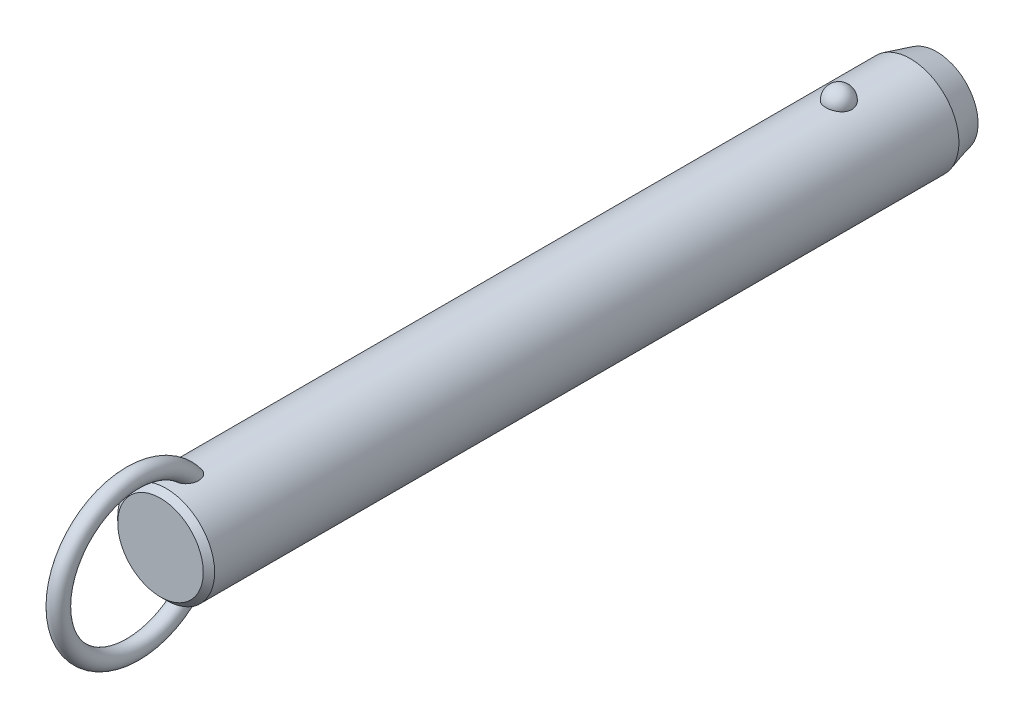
ISO-10303-21;
HEADER;
FILE_DESCRIPTION(('STEP AP214'),'2;1');
FILE_NAME('part.step','',(''),(''),'','','');
FILE_SCHEMA(('AUTOMOTIVE_DESIGN { 1 0 10303 214 1 1 1 1 }'));
ENDSEC;
DATA;
#1=APPLICATION_CONTEXT('core data for automotive mechanical design processes');
#2=APPLICATION_PROTOCOL_DEFINITION('international standard','automotive_design',2000,#1);
#3=PRODUCT_CONTEXT('',#1,'mechanical');
#4=PRODUCT('Part','Part','',(#3));
#5=PRODUCT_RELATED_PRODUCT_CATEGORY('part','',(#4));
#6=PRODUCT_DEFINITION_FORMATION('','',#4);
#7=PRODUCT_DEFINITION_CONTEXT('part definition',#1,'design');
#8=PRODUCT_DEFINITION('design','',#6,#7);
#9=PRODUCT_DEFINITION_SHAPE('','',#8);
#10=(LENGTH_UNIT() NAMED_UNIT(*) SI_UNIT(.MILLI.,.METRE.));
#11=(NAMED_UNIT(*) PLANE_ANGLE_UNIT() SI_UNIT($,.RADIAN.));
#12=(NAMED_UNIT(*) SI_UNIT($,.STERADIAN.) SOLID_ANGLE_UNIT());
#13=UNCERTAINTY_MEASURE_WITH_UNIT(LENGTH_MEASURE(1.E-05),#10,'distance_accuracy_value','');
#14=(GEOMETRIC_REPRESENTATION_CONTEXT(3) GLOBAL_UNCERTAINTY_ASSIGNED_CONTEXT((#13)) GLOBAL_UNIT_ASSIGNED_CONTEXT((#10,
#11,#12)) REPRESENTATION_CONTEXT('',''));
#15=CARTESIAN_POINT('',(0.,0.,0.));
#16=DIRECTION('',(0.,0.,1.));
#17=DIRECTION('',(1.,0.,0.));
#18=AXIS2_PLACEMENT_3D('',#15,#16,#17);
#19=CARTESIAN_POINT('',(0.,0.,139.7));
#20=DIRECTION('',(0.,0.,-1.));
#21=DIRECTION('',(-1.,0.,0.));
#22=AXIS2_PLACEMENT_3D('',#19,#20,#21);
#23=CYLINDRICAL_SURFACE('',#22,11.1);
#24=CARTESIAN_POINT('',(2.9724815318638,10.6945945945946,-3.));
#25=CARTESIAN_POINT('',(2.97247830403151,10.6945972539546,-2.83225059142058));
#26=CARTESIAN_POINT('',(2.95876598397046,10.6984356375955,-2.66445972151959));
#27=CARTESIAN_POINT('',(2.90424529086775,10.7133624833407,-2.33362381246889));
#28=CARTESIAN_POINT('',(2.8634252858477,10.7244540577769,-2.1705808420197));
#29=CARTESIAN_POINT('',(2.75573657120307,10.7526272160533,-1.85396767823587));
#30=CARTESIAN_POINT('',(2.68887937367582,10.7697061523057,-1.70039333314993));
#31=CARTESIAN_POINT('',(2.53079696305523,10.8079438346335,-1.40691598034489));
#32=CARTESIAN_POINT('',(2.43957264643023,10.8291024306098,-1.2670124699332));
#33=CARTESIAN_POINT('',(2.23458150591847,10.8732541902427,-1.00409565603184));
#34=CARTESIAN_POINT('',(2.12071295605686,10.8962553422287,-0.881162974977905));
#35=CARTESIAN_POINT('',(1.87365402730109,10.9414421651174,-0.656352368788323));
#36=CARTESIAN_POINT('',(1.74046358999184,10.9636278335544,-0.554474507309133));
#37=CARTESIAN_POINT('',(1.45872188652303,11.0046495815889,-0.374872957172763));
#38=CARTESIAN_POINT('',(1.31021276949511,11.0234944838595,-0.297085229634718));
#39=CARTESIAN_POINT('',(1.00170030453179,11.0557957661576,-0.167529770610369));
#40=CARTESIAN_POINT('',(0.841698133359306,11.0692526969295,-0.115759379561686));
#41=CARTESIAN_POINT('',(0.517607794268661,11.0890932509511,-0.0403925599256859));
#42=CARTESIAN_POINT('',(0.353633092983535,11.0955916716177,-0.0163383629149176));
#43=CARTESIAN_POINT('',(0.0238420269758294,11.1011989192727,0.0044517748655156));
#44=CARTESIAN_POINT('',(-0.141974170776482,11.1003084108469,0.00119017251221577));
#45=CARTESIAN_POINT('',(-0.468405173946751,11.0912990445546,-0.0323233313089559));
#46=CARTESIAN_POINT('',(-0.629059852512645,11.0832767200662,-0.0622147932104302));
#47=CARTESIAN_POINT('',(-0.942937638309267,11.0609962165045,-0.147645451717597));
#48=CARTESIAN_POINT('',(-1.09616062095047,11.0467379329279,-0.203185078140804));
#49=CARTESIAN_POINT('',(-1.39181061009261,11.0134071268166,-0.3387529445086));
#50=CARTESIAN_POINT('',(-1.53417383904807,10.9943086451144,-0.418913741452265));
#51=CARTESIAN_POINT('',(-1.80342160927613,10.9533667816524,-0.60144882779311));
#52=CARTESIAN_POINT('',(-1.9303046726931,10.9315231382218,-0.703825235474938));
#53=CARTESIAN_POINT('',(-2.16747598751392,10.887005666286,-0.930091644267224));
#54=CARTESIAN_POINT('',(-2.27742774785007,10.8643239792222,-1.05433291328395));
#55=CARTESIAN_POINT('',(-2.47517316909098,10.8209886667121,-1.31966633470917));
#56=CARTESIAN_POINT('',(-2.56296538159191,10.8003351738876,-1.46075958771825));
#57=CARTESIAN_POINT('',(-2.71500300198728,10.7631304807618,-1.75753646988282));
#58=CARTESIAN_POINT('',(-2.77898901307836,10.7466250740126,-1.91335887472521));
#59=CARTESIAN_POINT('',(-2.88046189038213,10.7198747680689,-2.2339152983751));
#60=CARTESIAN_POINT('',(-2.91794947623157,10.709629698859,-2.39864907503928));
#61=CARTESIAN_POINT('',(-2.96537819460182,10.6965949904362,-2.73165170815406));
#62=CARTESIAN_POINT('',(-2.97542891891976,10.693775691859,-2.89990378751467));
#63=CARTESIAN_POINT('',(-2.96804271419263,10.6958279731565,-3.235752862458));
#64=CARTESIAN_POINT('',(-2.95060646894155,10.7006993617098,-3.40334987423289));
#65=CARTESIAN_POINT('',(-2.88883358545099,10.71753912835,-3.73233906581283));
#66=CARTESIAN_POINT('',(-2.84462026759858,10.7294749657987,-3.89375610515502));
#67=CARTESIAN_POINT('',(-2.73050447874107,10.7590797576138,-4.20667949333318));
#68=CARTESIAN_POINT('',(-2.66060103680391,10.7767489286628,-4.35818546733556));
#69=CARTESIAN_POINT('',(-2.49642559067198,10.8159599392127,-4.6478542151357));
#70=CARTESIAN_POINT('',(-2.40203047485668,10.8375211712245,-4.78594458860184));
#71=CARTESIAN_POINT('',(-2.19143488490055,10.8820570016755,-5.0441038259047));
#72=CARTESIAN_POINT('',(-2.07523364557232,10.9050316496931,-5.16417205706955));
#73=CARTESIAN_POINT('',(-1.82361254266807,10.9499219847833,-5.38334833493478));
#74=CARTESIAN_POINT('',(-1.68812945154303,10.9718338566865,-5.48238464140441));
#75=CARTESIAN_POINT('',(-1.40191298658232,11.0120611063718,-5.65618873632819));
#76=CARTESIAN_POINT('',(-1.25118062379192,11.0303767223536,-5.73095813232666));
#77=CARTESIAN_POINT('',(-0.940570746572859,11.0611653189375,-5.85334725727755));
#78=CARTESIAN_POINT('',(-0.780821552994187,11.0737044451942,-5.90127578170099));
#79=CARTESIAN_POINT('',(-0.455204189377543,11.0918598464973,-5.96992976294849));
#80=CARTESIAN_POINT('',(-0.289336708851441,11.0974768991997,-5.99065827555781));
#81=CARTESIAN_POINT('',(0.0406846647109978,11.1011307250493,-6.00418773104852));
#82=CARTESIAN_POINT('',(0.204817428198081,11.099299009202,-5.99747318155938));
#83=CARTESIAN_POINT('',(0.5295530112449,11.088551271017,-5.9574031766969));
#84=CARTESIAN_POINT('',(0.69015594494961,11.0796354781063,-5.92404858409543));
#85=CARTESIAN_POINT('',(1.0027760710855,11.0557204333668,-5.83180084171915));
#86=CARTESIAN_POINT('',(1.15482001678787,11.0407414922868,-5.77299291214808));
#87=CARTESIAN_POINT('',(1.44678373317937,11.0062913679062,-5.63147366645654));
#88=CARTESIAN_POINT('',(1.58670279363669,10.9868199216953,-5.54876095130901));
#89=CARTESIAN_POINT('',(1.8527023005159,10.9451315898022,-5.36027644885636));
#90=CARTESIAN_POINT('',(1.97855158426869,10.9228788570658,-5.25418644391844));
#91=CARTESIAN_POINT('',(2.21080872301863,10.8782509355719,-5.02251354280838));
#92=CARTESIAN_POINT('',(2.31721312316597,10.8558757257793,-4.89692718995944));
#93=CARTESIAN_POINT('',(2.5094551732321,10.8130715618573,-4.62745408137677));
#94=CARTESIAN_POINT('',(2.59493284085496,10.7926798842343,-4.48330448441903));
#95=CARTESIAN_POINT('',(2.740862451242,10.7565495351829,-4.18236358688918));
#96=CARTESIAN_POINT('',(2.80132490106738,10.7408089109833,-4.02557762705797));
#97=CARTESIAN_POINT('',(2.88959070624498,10.7173718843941,-3.72475308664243));
#98=CARTESIAN_POINT('',(2.92062102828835,10.7088950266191,-3.58171216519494));
#99=CARTESIAN_POINT('',(2.96206765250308,10.6975052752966,-3.29245795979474));
#100=CARTESIAN_POINT('',(2.97248434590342,10.6945922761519,-3.14624473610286));
#101=CARTESIAN_POINT('',(2.9724815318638,10.6945945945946,-3.));
#102=B_SPLINE_CURVE_WITH_KNOTS('',3,(#24,#25,#26,#27,#28,#29,#30,#31,#32,#33,#34,#35,#36,#37,
#38,#39,#40,#41,#42,#43,#44,#45,#46,#47,#48,#49,#50,#51,#52,#53,#54,#55,#56,#57,#58,#59,#60,#61,
#62,#63,#64,#65,#66,#67,#68,#69,#70,#71,#72,#73,#74,#75,#76,#77,#78,#79,#80,#81,#82,#83,#84,#85,
#86,#87,#88,#89,#90,#91,#92,#93,#94,#95,#96,#97,#98,#99,#100,#101),.UNSPECIFIED.,.T.,.F.,(4,2,2,
2,2,2,2,2,2,2,2,2,2,2,2,2,2,2,2,2,2,2,2,2,2,2,2,2,2,2,2,2,2,2,2,2,2,2,4),(0.,0.502722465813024,
1.00566079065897,1.5083769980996,2.01107471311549,2.51608392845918,3.02109467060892,
3.52475118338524,4.02835620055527,4.523518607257,5.0186364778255,5.50715297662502,
5.9956776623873,6.48688002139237,6.97812923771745,7.47814366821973,7.9781907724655,
8.48353712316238,8.9888697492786,9.49218093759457,9.99547960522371,10.4964777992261,
10.997494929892,11.5010810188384,12.0046847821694,12.5099796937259,13.0152411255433,
13.5145635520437,14.0138298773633,14.5043200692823,14.9947943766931,15.4836390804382,
15.9725123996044,16.4685040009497,16.9645836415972,17.4686765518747,17.972557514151,
18.410841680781,18.849117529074),.UNSPECIFIED.);
#103=CARTESIAN_POINT('',(2.9724815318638,10.6945945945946,-3.));
#104=VERTEX_POINT('',#103);
#105=EDGE_CURVE('E41',#104,#104,#102,.T.);
#106=ORIENTED_EDGE('',*,*,#105,.T.);
#107=EDGE_LOOP('',(#106));
#108=FACE_BOUND('',#107,.T.);
#109=CARTESIAN_POINT('',(0.,0.,151.1));
#110=DIRECTION('',(0.,0.,1.));
#111=DIRECTION('',(1.,0.,0.));
#112=AXIS2_PLACEMENT_3D('',#109,#110,#111);
#113=CIRCLE('',#112,11.1);
#114=CARTESIAN_POINT('',(11.1,0.,151.1));
#115=VERTEX_POINT('',#114);
#116=EDGE_CURVE('E10',#115,#115,#113,.F.);
#117=ORIENTED_EDGE('',*,*,#116,.T.);
#118=EDGE_LOOP('',(#117));
#119=FACE_BOUND('',#118,.T.);
#120=CARTESIAN_POINT('',(-0.564520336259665,-11.0856356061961,143.357815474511));
#121=CARTESIAN_POINT('',(-0.667202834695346,-11.0804062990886,143.391283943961));
#122=CARTESIAN_POINT('',(-0.766875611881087,-11.0738877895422,143.433835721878));
#123=CARTESIAN_POINT('',(-0.95728412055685,-11.0590576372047,143.535419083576));
#124=CARTESIAN_POINT('',(-1.04801616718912,-11.0507452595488,143.59445742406));
#125=CARTESIAN_POINT('',(-1.21800952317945,-11.0333016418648,143.726529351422));
#126=CARTESIAN_POINT('',(-1.2973080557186,-11.0241732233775,143.799515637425));
#127=CARTESIAN_POINT('',(-1.44337665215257,-11.0060026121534,143.957037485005));
#128=CARTESIAN_POINT('',(-1.51014622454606,-10.9969604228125,144.041573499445));
#129=CARTESIAN_POINT('',(-1.63454620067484,-10.9791841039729,144.225521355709));
#130=CARTESIAN_POINT('',(-1.69127003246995,-10.9705107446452,144.325549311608));
#131=CARTESIAN_POINT('',(-1.7898078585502,-10.9548648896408,144.532790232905));
#132=CARTESIAN_POINT('',(-1.83161214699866,-10.9478935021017,144.640007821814));
#133=CARTESIAN_POINT('',(-1.91557028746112,-10.9335803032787,144.905408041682));
#134=CARTESIAN_POINT('',(-1.95040620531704,-10.9273269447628,145.065980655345));
#135=CARTESIAN_POINT('',(-1.99388326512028,-10.9194709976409,145.390697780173));
#136=CARTESIAN_POINT('',(-2.00248051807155,-10.9178762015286,145.554847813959));
#137=CARTESIAN_POINT('',(-1.99551615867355,-10.9191578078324,145.924650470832));
#138=CARTESIAN_POINT('',(-1.9732206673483,-10.9232807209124,146.130191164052));
#139=CARTESIAN_POINT('',(-1.9152976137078,-10.9335244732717,146.433595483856));
#140=CARTESIAN_POINT('',(-1.89184575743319,-10.9376266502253,146.534088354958));
#141=CARTESIAN_POINT('',(-1.83700674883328,-10.9469720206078,146.732855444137));
#142=CARTESIAN_POINT('',(-1.80562070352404,-10.9522150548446,146.831129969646));
#143=CARTESIAN_POINT('',(-1.73463055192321,-10.9636837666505,147.025914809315));
#144=CARTESIAN_POINT('',(-1.69493416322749,-10.9699202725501,147.122390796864));
#145=CARTESIAN_POINT('',(-1.60745141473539,-10.9830806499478,147.311626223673));
#146=CARTESIAN_POINT('',(-1.55966150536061,-10.9900048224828,147.404384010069));
#147=CARTESIAN_POINT('',(-1.45591812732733,-11.0042280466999,147.584690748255));
#148=CARTESIAN_POINT('',(-1.40000013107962,-11.0115253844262,147.672260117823));
#149=CARTESIAN_POINT('',(-1.27937470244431,-11.0261911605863,147.841029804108));
#150=CARTESIAN_POINT('',(-1.21467835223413,-11.0335594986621,147.92223795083));
#151=CARTESIAN_POINT('',(-1.08218150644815,-11.0473027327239,148.069001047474));
#152=CARTESIAN_POINT('',(-1.01522633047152,-11.0537063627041,148.135309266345));
#153=CARTESIAN_POINT('',(-0.872952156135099,-11.065850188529,148.258378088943));
#154=CARTESIAN_POINT('',(-0.797642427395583,-11.0715911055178,148.315149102));
#155=CARTESIAN_POINT('',(-0.651396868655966,-11.081071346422,148.407515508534));
#156=CARTESIAN_POINT('',(-0.581712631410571,-11.0849841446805,148.445049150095));
#157=CARTESIAN_POINT('',(-0.437066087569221,-11.0916271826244,148.508259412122));
#158=CARTESIAN_POINT('',(-0.362109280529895,-11.0943586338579,148.533948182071));
#159=CARTESIAN_POINT('',(-0.207828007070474,-11.0983242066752,148.571117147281));
#160=CARTESIAN_POINT('',(-0.12846771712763,-11.0995432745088,148.582454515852));
#161=CARTESIAN_POINT('',(0.0309101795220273,-11.1002423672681,148.588965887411));
#162=CARTESIAN_POINT('',(0.110927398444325,-11.0997233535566,148.584148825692));
#163=CARTESIAN_POINT('',(0.25640659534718,-11.097240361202,148.560959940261));
#164=CARTESIAN_POINT('',(0.322235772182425,-11.0955074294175,148.544754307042));
#165=CARTESIAN_POINT('',(0.450635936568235,-11.0910350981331,148.502600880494));
#166=CARTESIAN_POINT('',(0.513205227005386,-11.0882951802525,148.476648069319));
#167=CARTESIAN_POINT('',(0.662626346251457,-11.0805620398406,148.402607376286));
#168=CARTESIAN_POINT('',(0.747127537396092,-11.0751144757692,148.349845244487));
#169=CARTESIAN_POINT('',(0.906756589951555,-11.0631932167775,148.231720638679));
#170=CARTESIAN_POINT('',(0.981859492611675,-11.0567168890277,148.166325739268));
#171=CARTESIAN_POINT('',(1.10712207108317,-11.0447856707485,148.04226337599));
#172=CARTESIAN_POINT('',(1.15909566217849,-11.0394280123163,147.985383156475));
#173=CARTESIAN_POINT('',(1.2579192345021,-11.0286040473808,147.867327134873));
#174=CARTESIAN_POINT('',(1.30476642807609,-11.0231376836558,147.806149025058));
#175=CARTESIAN_POINT('',(1.43818612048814,-11.0068027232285,147.617305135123));
#176=CARTESIAN_POINT('',(1.51751767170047,-10.9960104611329,147.484453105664));
#177=CARTESIAN_POINT('',(1.63597546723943,-10.9788847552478,147.253137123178));
#178=CARTESIAN_POINT('',(1.67988876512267,-10.9722190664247,147.157053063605));
#179=CARTESIAN_POINT('',(1.75953241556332,-10.9597298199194,146.961431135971));
#180=CARTESIAN_POINT('',(1.7952596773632,-10.9539065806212,146.861891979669));
#181=CARTESIAN_POINT('',(1.85844731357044,-10.9433632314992,146.66021118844));
#182=CARTESIAN_POINT('',(1.88591073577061,-10.9386427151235,146.55807052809));
#183=CARTESIAN_POINT('',(1.93234324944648,-10.9305350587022,146.351819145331));
#184=CARTESIAN_POINT('',(1.95131065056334,-10.9271481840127,146.247708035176));
#185=CARTESIAN_POINT('',(1.9904020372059,-10.9201183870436,145.965458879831));
#186=CARTESIAN_POINT('',(2.00221217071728,-10.9179256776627,145.786037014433));
#187=CARTESIAN_POINT('',(1.99711676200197,-10.9188636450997,145.427713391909));
#188=CARTESIAN_POINT('',(1.98026150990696,-10.9219849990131,145.248811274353));
#189=CARTESIAN_POINT('',(1.92151657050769,-10.9324473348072,144.93645144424));
#190=CARTESIAN_POINT('',(1.88605081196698,-10.9386915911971,144.801759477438));
#191=CARTESIAN_POINT('',(1.79393020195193,-10.9541780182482,144.539966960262));
#192=CARTESIAN_POINT('',(1.73729868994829,-10.9634168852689,144.412858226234));
#193=CARTESIAN_POINT('',(1.61237037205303,-10.9824218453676,144.189418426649));
#194=CARTESIAN_POINT('',(1.54715374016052,-10.9918945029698,144.091345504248));
#195=CARTESIAN_POINT('',(1.40127026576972,-11.0114415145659,143.907434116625));
#196=CARTESIAN_POINT('',(1.32060742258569,-11.0215157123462,143.821592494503));
#197=CARTESIAN_POINT('',(1.1447478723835,-11.041168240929,143.665163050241));
#198=CARTESIAN_POINT('',(1.04947805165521,-11.0507437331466,143.594656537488));
#199=CARTESIAN_POINT('',(0.847278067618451,-11.0680789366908,143.472640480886));
#200=CARTESIAN_POINT('',(0.74035174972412,-11.0758392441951,143.421124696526));
#201=CARTESIAN_POINT('',(0.529289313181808,-11.0878275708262,143.343485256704));
#202=CARTESIAN_POINT('',(0.425895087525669,-11.0923259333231,143.315377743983));
#203=CARTESIAN_POINT('',(0.215723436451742,-11.0984001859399,143.277703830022));
#204=CARTESIAN_POINT('',(0.108947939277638,-11.0999777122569,143.268127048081));
#205=CARTESIAN_POINT('',(-0.0938962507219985,-11.1000196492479,143.267877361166));
#206=CARTESIAN_POINT('',(-0.189967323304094,-11.0987797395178,143.275408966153));
#207=CARTESIAN_POINT('',(-0.379657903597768,-11.0939111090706,143.305507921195));
#208=CARTESIAN_POINT('',(-0.47327735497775,-11.0902823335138,143.328075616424));
#209=CARTESIAN_POINT('',(-0.564520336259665,-11.0856356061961,143.357815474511));
#210=B_SPLINE_CURVE_WITH_KNOTS('',3,(#120,#121,#122,#123,#124,#125,#126,#127,#128,#129,#130,
#131,#132,#133,#134,#135,#136,#137,#138,#139,#140,#141,#142,#143,#144,#145,#146,#147,#148,#149,
#150,#151,#152,#153,#154,#155,#156,#157,#158,#159,#160,#161,#162,#163,#164,#165,#166,#167,#168,
#169,#170,#171,#172,#173,#174,#175,#176,#177,#178,#179,#180,#181,#182,#183,#184,#185,#186,#187,
#188,#189,#190,#191,#192,#193,#194,#195,#196,#197,#198,#199,#200,#201,#202,#203,#204,#205,#206,
#207,#208,#209),.UNSPECIFIED.,.T.,.F.,(4,2,2,2,2,2,2,2,2,2,2,2,2,2,2,2,2,2,2,2,2,2,2,2,2,2,2,2,
2,2,2,2,2,2,2,2,2,2,2,2,2,2,2,2,4),(0.,0.323999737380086,0.64813245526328,0.971184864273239,
1.29424994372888,1.63886237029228,1.98369857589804,2.47426059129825,2.96564271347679,
3.58257396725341,3.89215258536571,4.20168803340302,4.51486273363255,4.82817514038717,
5.14015911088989,5.45175282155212,5.73442856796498,6.01679375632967,6.2536458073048,
6.49025437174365,6.72919963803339,6.96801276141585,7.17061258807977,7.37331685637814,
7.67094989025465,7.96935728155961,8.20075067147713,8.43226927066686,8.89581623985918,
9.21306533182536,9.53043400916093,9.84768549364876,10.1650000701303,10.7022930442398,
11.2386443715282,11.655339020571,12.071575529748,12.4245637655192,12.7774607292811,
13.1321855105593,13.4867936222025,13.8068771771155,14.1267813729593,14.4146787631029,
14.7025827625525),.UNSPECIFIED.);
#211=CARTESIAN_POINT('',(-0.564520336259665,-11.0856356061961,143.357815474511));
#212=VERTEX_POINT('',#211);
#213=EDGE_CURVE('E60',#212,#212,#210,.T.);
#214=ORIENTED_EDGE('',*,*,#213,.T.);
#215=EDGE_LOOP('',(#214));
#216=FACE_BOUND('',#215,.T.);
#217=CARTESIAN_POINT('',(-0.564520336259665,11.0856356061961,143.357815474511));
#218=CARTESIAN_POINT('',(-0.468542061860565,11.0905203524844,143.326545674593));
#219=CARTESIAN_POINT('',(-0.369793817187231,11.0942886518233,143.303157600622));
#220=CARTESIAN_POINT('',(-0.169555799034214,11.0991586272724,143.273085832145));
#221=CARTESIAN_POINT('',(-0.0680604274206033,11.1002543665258,143.26643932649));
#222=CARTESIAN_POINT('',(0.134549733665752,11.099646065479,143.270157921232));
#223=CARTESIAN_POINT('',(0.235664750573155,11.0979441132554,143.28051033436));
#224=CARTESIAN_POINT('',(0.434632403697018,11.0919342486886,143.317831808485));
#225=CARTESIAN_POINT('',(0.532486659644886,11.0876276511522,143.344792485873));
#226=CARTESIAN_POINT('',(0.722445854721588,11.0768742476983,143.4144096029));
#227=CARTESIAN_POINT('',(0.814543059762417,11.0704246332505,143.457086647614));
#228=CARTESIAN_POINT('',(0.990565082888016,11.0560659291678,143.556648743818));
#229=CARTESIAN_POINT('',(1.07448844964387,11.048156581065,143.613536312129));
#230=CARTESIAN_POINT('',(1.23562672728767,11.0313221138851,143.742210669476));
#231=CARTESIAN_POINT('',(1.3124268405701,11.0223686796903,143.814511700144));
#232=CARTESIAN_POINT('',(1.45398030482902,11.0045918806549,143.970042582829));
#233=CARTESIAN_POINT('',(1.51873073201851,10.9957685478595,144.053275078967));
#234=CARTESIAN_POINT('',(1.64107232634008,10.9782087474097,144.236384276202));
#235=CARTESIAN_POINT('',(1.6974317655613,10.9695572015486,144.337089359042));
#236=CARTESIAN_POINT('',(1.79515063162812,10.9539887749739,144.545626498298));
#237=CARTESIAN_POINT('',(1.83649966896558,10.9470730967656,144.65346343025));
#238=CARTESIAN_POINT('',(1.91931148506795,10.9329211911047,144.920399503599));
#239=CARTESIAN_POINT('',(1.95340104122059,10.9267904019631,145.081861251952));
#240=CARTESIAN_POINT('',(1.99526195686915,10.9192174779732,145.40821631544));
#241=CARTESIAN_POINT('',(2.00298989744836,10.9177830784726,145.57311484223));
#242=CARTESIAN_POINT('',(1.99396251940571,10.9194420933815,145.944100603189));
#243=CARTESIAN_POINT('',(1.97050829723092,10.923774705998,146.15003871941));
#244=CARTESIAN_POINT('',(1.91079643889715,10.9343131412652,146.453901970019));
#245=CARTESIAN_POINT('',(1.88673702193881,10.9385106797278,146.554529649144));
#246=CARTESIAN_POINT('',(1.8306550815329,10.9480376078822,146.753510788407));
#247=CARTESIAN_POINT('',(1.79863369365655,10.9533668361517,146.851864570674));
#248=CARTESIAN_POINT('',(1.72633365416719,10.9649954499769,147.046720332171));
#249=CARTESIAN_POINT('',(1.68596409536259,10.9713053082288,147.14318790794));
#250=CARTESIAN_POINT('',(1.59707998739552,10.9845964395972,147.332323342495));
#251=CARTESIAN_POINT('',(1.54856169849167,10.9915780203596,147.424989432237));
#252=CARTESIAN_POINT('',(1.44330168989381,11.0058935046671,147.604975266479));
#253=CARTESIAN_POINT('',(1.3865974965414,11.0132257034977,147.692316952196));
#254=CARTESIAN_POINT('',(1.26431158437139,11.0279330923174,147.860456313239));
#255=CARTESIAN_POINT('',(1.19874160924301,11.0353082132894,147.941262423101));
#256=CARTESIAN_POINT('',(1.06542088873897,11.048931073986,148.085985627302));
#257=CARTESIAN_POINT('',(0.998640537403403,11.0552153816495,148.150784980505));
#258=CARTESIAN_POINT('',(0.856896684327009,11.0671032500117,148.270846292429));
#259=CARTESIAN_POINT('',(0.781942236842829,11.0727075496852,148.326118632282));
#260=CARTESIAN_POINT('',(0.636276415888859,11.081949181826,148.415972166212));
#261=CARTESIAN_POINT('',(0.566755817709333,11.0857572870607,148.452441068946));
#262=CARTESIAN_POINT('',(0.422602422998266,11.0921860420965,148.513533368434));
#263=CARTESIAN_POINT('',(0.347974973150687,11.0948079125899,148.538168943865));
#264=CARTESIAN_POINT('',(0.194593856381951,11.0985608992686,148.573323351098));
#265=CARTESIAN_POINT('',(0.115807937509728,11.0996777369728,148.583706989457));
#266=CARTESIAN_POINT('',(-0.042249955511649,11.1002003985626,148.588574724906));
#267=CARTESIAN_POINT('',(-0.121521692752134,11.09960699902,148.583066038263));
#268=CARTESIAN_POINT('',(-0.26604624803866,11.0970123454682,148.558827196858));
#269=CARTESIAN_POINT('',(-0.331661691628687,11.0952283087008,148.542135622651));
#270=CARTESIAN_POINT('',(-0.459588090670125,11.0906663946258,148.499111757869));
#271=CARTESIAN_POINT('',(-0.521897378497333,11.0878880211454,148.472774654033));
#272=CARTESIAN_POINT('',(-0.671446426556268,11.0800342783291,148.397513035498));
#273=CARTESIAN_POINT('',(-0.756250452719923,11.0744969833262,148.343818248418));
#274=CARTESIAN_POINT('',(-0.916349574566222,11.0624045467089,148.223802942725));
#275=CARTESIAN_POINT('',(-0.991618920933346,11.0558467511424,148.157449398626));
#276=CARTESIAN_POINT('',(-1.11713140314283,11.0437783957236,148.031633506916));
#277=CARTESIAN_POINT('',(-1.16920539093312,11.0383619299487,147.973952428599));
#278=CARTESIAN_POINT('',(-1.26817476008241,11.02743010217,147.854280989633));
#279=CARTESIAN_POINT('',(-1.31506731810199,11.0219146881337,147.792288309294));
#280=CARTESIAN_POINT('',(-1.40399813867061,11.0109399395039,147.664784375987));
#281=CARTESIAN_POINT('',(-1.44602864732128,11.0054807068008,147.599267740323));
#282=CARTESIAN_POINT('',(-1.52538779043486,10.9947621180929,147.465422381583));
#283=CARTESIAN_POINT('',(-1.56271516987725,10.9895028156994,147.397092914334));
#284=CARTESIAN_POINT('',(-1.64537943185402,10.9774790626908,147.233210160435));
#285=CARTESIAN_POINT('',(-1.68879497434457,10.9708503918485,147.1366735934));
#286=CARTESIAN_POINT('',(-1.76740738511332,10.9584602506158,146.940236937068));
#287=CARTESIAN_POINT('',(-1.80260120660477,10.95269910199,146.84033561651));
#288=CARTESIAN_POINT('',(-1.86468657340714,10.9423003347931,146.637966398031));
#289=CARTESIAN_POINT('',(-1.8915816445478,10.9376622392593,146.535499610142));
#290=CARTESIAN_POINT('',(-1.93682458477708,10.9297405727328,146.328642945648));
#291=CARTESIAN_POINT('',(-1.95517082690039,10.9264572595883,146.224252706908));
#292=CARTESIAN_POINT('',(-1.99232562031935,10.9197647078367,145.94262876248));
#293=CARTESIAN_POINT('',(-2.00294603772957,10.9177914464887,145.764185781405));
#294=CARTESIAN_POINT('',(-1.99566675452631,10.9191290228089,145.407996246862));
#295=CARTESIAN_POINT('',(-1.97781651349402,10.9224306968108,145.23024902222));
#296=CARTESIAN_POINT('',(-1.91747214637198,10.9331592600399,144.919792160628));
#297=CARTESIAN_POINT('',(-1.88131022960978,10.9395108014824,144.785825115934));
#298=CARTESIAN_POINT('',(-1.78790380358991,10.9551659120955,144.52559757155));
#299=CARTESIAN_POINT('',(-1.73068309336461,10.9644661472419,144.399328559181));
#300=CARTESIAN_POINT('',(-1.60475573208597,10.9835398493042,144.17741565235));
#301=CARTESIAN_POINT('',(-1.53908879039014,10.9930297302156,144.080026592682));
#302=CARTESIAN_POINT('',(-1.39238608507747,11.0125708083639,143.897525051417));
#303=CARTESIAN_POINT('',(-1.31135150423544,11.0226219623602,143.812411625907));
#304=CARTESIAN_POINT('',(-1.14382035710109,11.0411991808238,143.66529943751));
#305=CARTESIAN_POINT('',(-1.0585850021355,11.0497792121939,143.60186930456));
#306=CARTESIAN_POINT('',(-0.878723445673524,11.0655285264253,143.490250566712));
#307=CARTESIAN_POINT('',(-0.784123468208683,11.0727015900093,143.442020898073));
#308=CARTESIAN_POINT('',(-0.646163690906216,11.0812501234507,143.386023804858));
#309=CARTESIAN_POINT('',(-0.605595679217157,11.0835451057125,143.371197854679));
#310=CARTESIAN_POINT('',(-0.564520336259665,11.0856356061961,143.357815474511));
#311=B_SPLINE_CURVE_WITH_KNOTS('',3,(#217,#218,#219,#220,#221,#222,#223,#224,#225,#226,#227,
#228,#229,#230,#231,#232,#233,#234,#235,#236,#237,#238,#239,#240,#241,#242,#243,#244,#245,#246,
#247,#248,#249,#250,#251,#252,#253,#254,#255,#256,#257,#258,#259,#260,#261,#262,#263,#264,#265,
#266,#267,#268,#269,#270,#271,#272,#273,#274,#275,#276,#277,#278,#279,#280,#281,#282,#283,#284,
#285,#286,#287,#288,#289,#290,#291,#292,#293,#294,#295,#296,#297,#298,#299,#300,#301,#302,#303,
#304,#305,#306,#307,#308,#309,#310),.UNSPECIFIED.,.T.,.F.,(4,2,2,2,2,2,2,2,2,2,2,2,2,2,2,2,2,2,
2,2,2,2,2,2,2,2,2,2,2,2,2,2,2,2,2,2,2,2,2,2,2,2,2,2,2,2,4),(0.,0.303061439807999,
0.606795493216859,0.910302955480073,1.21365733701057,1.51741085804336,1.82121821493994,
2.13745205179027,2.45376252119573,2.79958678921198,3.14564996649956,3.63832391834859,
4.13180893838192,4.75031912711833,5.06071926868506,5.37107516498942,5.6850077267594,
5.99908475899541,6.31176519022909,6.62403542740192,6.90315673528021,7.18197194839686,
7.41687778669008,7.65154134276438,7.88841587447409,8.12518286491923,8.32752842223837,
8.52997509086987,8.82986421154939,9.13054668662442,9.36393502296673,9.5974499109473,
9.83133221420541,10.0652767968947,10.383032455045,10.7009056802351,11.0186436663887,
11.3364420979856,11.8705925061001,12.4038159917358,12.8189662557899,13.2336487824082,
13.5857049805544,13.9377340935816,14.2561354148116,14.5736690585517,14.7033687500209),.UNSPECIFIED.);
#312=CARTESIAN_POINT('',(-0.564520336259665,11.0856356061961,143.357815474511));
#313=VERTEX_POINT('',#312);
#314=EDGE_CURVE('E68',#313,#313,#311,.T.);
#315=ORIENTED_EDGE('',*,*,#314,.T.);
#316=EDGE_LOOP('',(#315));
#317=FACE_BOUND('',#316,.T.);
#318=CARTESIAN_POINT('',(0.,0.,-19.3999999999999));
#319=DIRECTION('',(0.,0.,-1.));
#320=DIRECTION('',(-1.,0.,0.));
#321=AXIS2_PLACEMENT_3D('',#318,#319,#320);
#322=CIRCLE('',#321,11.1);
#323=CARTESIAN_POINT('',(-11.1,0.,-19.3999999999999));
#324=VERTEX_POINT('',#323);
#325=EDGE_CURVE('E57',#324,#324,#322,.F.);
#326=ORIENTED_EDGE('',*,*,#325,.T.);
#327=EDGE_LOOP('',(#326));
#328=FACE_BOUND('',#327,.T.);
#329=ADVANCED_FACE('F37',(#108,#119,#216,#317,#328),#23,.T.);
#330=CARTESIAN_POINT('',(0.,0.,-25.4));
#331=DIRECTION('',(0.,0.,-1.));
#332=DIRECTION('',(-1.,0.,0.));
#333=AXIS2_PLACEMENT_3D('',#330,#331,#332);
#334=PLANE('',#333);
#335=CARTESIAN_POINT('',(0.,0.,-25.4));
#336=DIRECTION('',(0.,0.,-1.));
#337=DIRECTION('',(-1.,0.,0.));
#338=AXIS2_PLACEMENT_3D('',#335,#336,#337);
#339=CIRCLE('',#338,9.49230484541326);
#340=CARTESIAN_POINT('',(-9.49230484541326,0.,-25.4));
#341=VERTEX_POINT('',#340);
#342=EDGE_CURVE('E67',#341,#341,#339,.T.);
#343=ORIENTED_EDGE('',*,*,#342,.T.);
#344=EDGE_LOOP('',(#343));
#345=FACE_BOUND('',#344,.T.);
#346=ADVANCED_FACE('F86',(#345),#334,.T.);
#347=CARTESIAN_POINT('',(0.,0.,-25.4));
#348=DIRECTION('',(0.,0.,1.));
#349=DIRECTION('',(1.,0.,0.));
#350=AXIS2_PLACEMENT_3D('',#347,#348,#349);
#351=CONICAL_SURFACE('',#350,9.49230484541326,0.261799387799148);
#352=ORIENTED_EDGE('',*,*,#325,.F.);
#353=EDGE_LOOP('',(#352));
#354=FACE_BOUND('',#353,.T.);
#355=ORIENTED_EDGE('',*,*,#342,.F.);
#356=EDGE_LOOP('',(#355));
#357=FACE_BOUND('',#356,.T.);
#358=ADVANCED_FACE('F84',(#354,#357),#351,.T.);
#359=CARTESIAN_POINT('',(0.,0.,152.4));
#360=DIRECTION('',(0.,0.,1.));
#361=DIRECTION('',(1.,0.,0.));
#362=AXIS2_PLACEMENT_3D('',#359,#360,#361);
#363=PLANE('',#362);
#364=CARTESIAN_POINT('',(0.,0.,152.4));
#365=DIRECTION('',(0.,0.,1.));
#366=DIRECTION('',(1.,0.,0.));
#367=AXIS2_PLACEMENT_3D('',#364,#365,#366);
#368=CIRCLE('',#367,9.8);
#369=CARTESIAN_POINT('',(9.8,0.,152.4));
#370=VERTEX_POINT('',#369);
#371=EDGE_CURVE('E50',#370,#370,#368,.T.);
#372=ORIENTED_EDGE('',*,*,#371,.T.);
#373=EDGE_LOOP('',(#372));
#374=FACE_BOUND('',#373,.T.);
#375=ADVANCED_FACE('F78',(#374),#363,.T.);
#376=CARTESIAN_POINT('',(0.,0.,158.75));
#377=DIRECTION('',(1.,0.,0.));
#378=DIRECTION('',(0.,0.,-1.));
#379=AXIS2_PLACEMENT_3D('',#376,#377,#378);
#380=TOROIDAL_SURFACE('',#379,17.05,2.);
#381=ORIENTED_EDGE('',*,*,#314,.F.);
#382=EDGE_LOOP('',(#381));
#383=FACE_BOUND('',#382,.T.);
#384=ORIENTED_EDGE('',*,*,#213,.F.);
#385=EDGE_LOOP('',(#384));
#386=FACE_BOUND('',#385,.T.);
#387=ADVANCED_FACE('F74',(#383,#386),#380,.T.);
#388=CARTESIAN_POINT('',(0.,0.,152.4));
#389=DIRECTION('',(0.,0.,-1.));
#390=DIRECTION('',(-1.,0.,0.));
#391=AXIS2_PLACEMENT_3D('',#388,#389,#390);
#392=CONICAL_SURFACE('',#391,9.8,0.785398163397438);
#393=ORIENTED_EDGE('',*,*,#116,.F.);
#394=EDGE_LOOP('',(#393));
#395=FACE_BOUND('',#394,.T.);
#396=ORIENTED_EDGE('',*,*,#371,.F.);
#397=EDGE_LOOP('',(#396));
#398=FACE_BOUND('',#397,.T.);
#399=ADVANCED_FACE('F39',(#395,#398),#392,.T.);
#400=CARTESIAN_POINT('',(0.,11.1,-3.));
#401=DIRECTION('',(0.,1.,0.));
#402=DIRECTION('',(0.,0.,-1.));
#403=AXIS2_PLACEMENT_3D('',#400,#401,#402);
#404=SPHERICAL_SURFACE('',#403,3.);
#405=ORIENTED_EDGE('',*,*,#105,.F.);
#406=EDGE_LOOP('',(#405));
#407=FACE_BOUND('',#406,.T.);
#408=ADVANCED_FACE('F80',(#407),#404,.T.);
#409=CLOSED_SHELL('',(#329,#346,#358,#375,#387,#399,#408));
#410=MANIFOLD_SOLID_BREP('B2',#409);
#411=ADVANCED_BREP_SHAPE_REPRESENTATION('',(#18,#410),#14);
#412=SHAPE_DEFINITION_REPRESENTATION(#9,#411);
ENDSEC;
END-ISO-10303-21;
